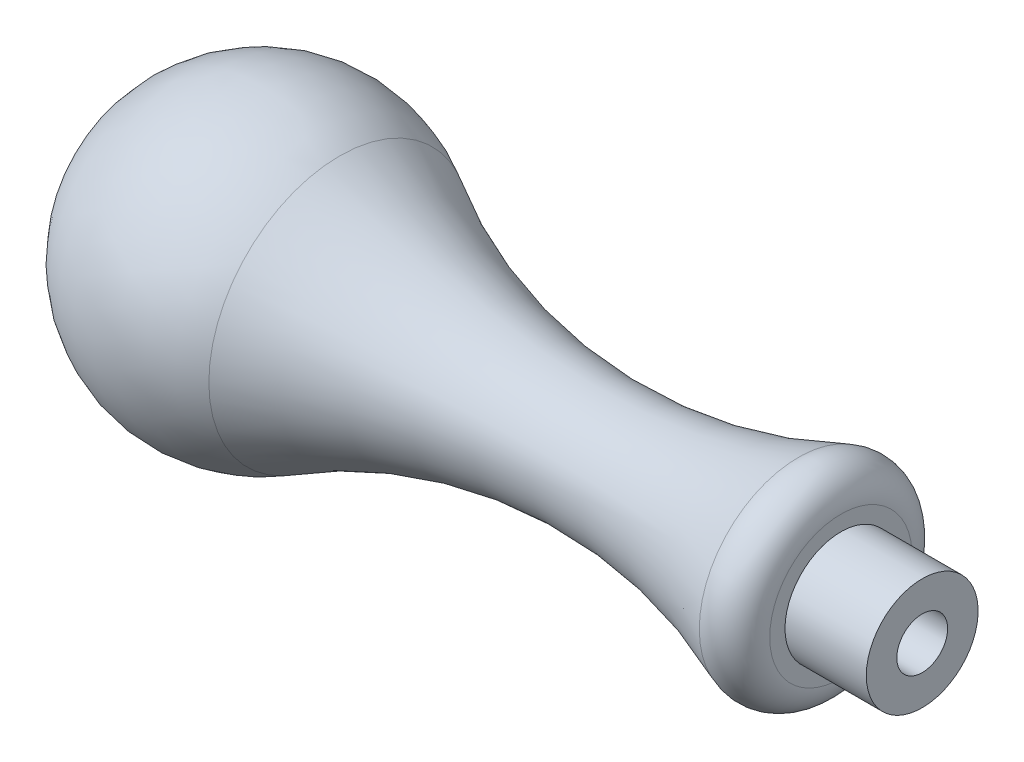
ISO-10303-21;
HEADER;
FILE_DESCRIPTION(('STEP AP214'),'2;1');
FILE_NAME('part.step','',(''),(''),'','','');
FILE_SCHEMA(('AUTOMOTIVE_DESIGN { 1 0 10303 214 1 1 1 1 }'));
ENDSEC;
DATA;
#1=APPLICATION_CONTEXT('core data for automotive mechanical design processes');
#2=APPLICATION_PROTOCOL_DEFINITION('international standard','automotive_design',2000,#1);
#3=PRODUCT_CONTEXT('',#1,'mechanical');
#4=PRODUCT('Part','Part','',(#3));
#5=PRODUCT_RELATED_PRODUCT_CATEGORY('part','',(#4));
#6=PRODUCT_DEFINITION_FORMATION('','',#4);
#7=PRODUCT_DEFINITION_CONTEXT('part definition',#1,'design');
#8=PRODUCT_DEFINITION('design','',#6,#7);
#9=PRODUCT_DEFINITION_SHAPE('','',#8);
#10=(LENGTH_UNIT() NAMED_UNIT(*) SI_UNIT(.MILLI.,.METRE.));
#11=(NAMED_UNIT(*) PLANE_ANGLE_UNIT() SI_UNIT($,.RADIAN.));
#12=(NAMED_UNIT(*) SI_UNIT($,.STERADIAN.) SOLID_ANGLE_UNIT());
#13=UNCERTAINTY_MEASURE_WITH_UNIT(LENGTH_MEASURE(1.E-05),#10,'distance_accuracy_value','');
#14=(GEOMETRIC_REPRESENTATION_CONTEXT(3) GLOBAL_UNCERTAINTY_ASSIGNED_CONTEXT((#13)) GLOBAL_UNIT_ASSIGNED_CONTEXT((#10,
#11,#12)) REPRESENTATION_CONTEXT('',''));
#15=CARTESIAN_POINT('',(0.,0.,0.));
#16=DIRECTION('',(0.,0.,1.));
#17=DIRECTION('',(1.,0.,0.));
#18=AXIS2_PLACEMENT_3D('',#15,#16,#17);
#19=CARTESIAN_POINT('',(0.,0.,0.));
#20=DIRECTION('',(-1.,0.,0.));
#21=DIRECTION('',(0.,1.,0.));
#22=AXIS2_PLACEMENT_3D('',#19,#20,#21);
#23=SPHERICAL_SURFACE('',#22,15.);
#24=CARTESIAN_POINT('',(7.69177216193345,0.,0.));
#25=DIRECTION('',(-1.,0.,0.));
#26=DIRECTION('',(0.,0.,1.));
#27=AXIS2_PLACEMENT_3D('',#24,#25,#26);
#28=CIRCLE('',#27,12.8777576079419);
#29=CARTESIAN_POINT('',(7.69177216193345,0.,12.8777576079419));
#30=VERTEX_POINT('',#29);
#31=EDGE_CURVE('E10',#30,#30,#28,.T.);
#32=ORIENTED_EDGE('',*,*,#31,.T.);
#33=EDGE_LOOP('',(#32));
#34=FACE_BOUND('',#33,.T.);
#35=ADVANCED_FACE('F31',(#34),#23,.T.);
#36=CARTESIAN_POINT('',(33.3310127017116,0.,0.));
#37=DIRECTION('',(-1.,0.,0.));
#38=DIRECTION('',(0.,0.,1.));
#39=AXIS2_PLACEMENT_3D('',#36,#37,#38);
#40=TOROIDAL_SURFACE('',#39,55.8036163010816,50.);
#41=ORIENTED_EDGE('',*,*,#31,.F.);
#42=EDGE_LOOP('',(#41));
#43=FACE_BOUND('',#42,.T.);
#44=CARTESIAN_POINT('',(52.8300573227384,0.,0.));
#45=DIRECTION('',(-1.,0.,0.));
#46=DIRECTION('',(0.,0.,1.));
#47=AXIS2_PLACEMENT_3D('',#44,#45,#46);
#48=CIRCLE('',#47,9.76246884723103);
#49=CARTESIAN_POINT('',(52.8300573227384,0.,9.76246884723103));
#50=VERTEX_POINT('',#49);
#51=EDGE_CURVE('E37',#50,#50,#48,.T.);
#52=ORIENTED_EDGE('',*,*,#51,.T.);
#53=EDGE_LOOP('',(#52));
#54=FACE_BOUND('',#53,.T.);
#55=ADVANCED_FACE('F72',(#43,#54),#40,.F.);
#56=CARTESIAN_POINT('',(54.,0.,0.));
#57=DIRECTION('',(-1.,0.,0.));
#58=DIRECTION('',(0.,0.,1.));
#59=AXIS2_PLACEMENT_3D('',#56,#57,#58);
#60=TOROIDAL_SURFACE('',#59,7.,3.);
#61=ORIENTED_EDGE('',*,*,#51,.F.);
#62=EDGE_LOOP('',(#61));
#63=FACE_BOUND('',#62,.T.);
#64=CARTESIAN_POINT('',(57.,0.,0.));
#65=DIRECTION('',(-1.,0.,0.));
#66=DIRECTION('',(0.,0.,1.));
#67=AXIS2_PLACEMENT_3D('',#64,#65,#66);
#68=CIRCLE('',#67,7.);
#69=CARTESIAN_POINT('',(57.,0.,7.));
#70=VERTEX_POINT('',#69);
#71=EDGE_CURVE('E41',#70,#70,#68,.T.);
#72=ORIENTED_EDGE('',*,*,#71,.T.);
#73=EDGE_LOOP('',(#72));
#74=FACE_BOUND('',#73,.T.);
#75=ADVANCED_FACE('F76',(#63,#74),#60,.T.);
#76=CARTESIAN_POINT('',(57.,7.,0.));
#77=DIRECTION('',(-1.,0.,0.));
#78=DIRECTION('',(0.,0.,1.));
#79=AXIS2_PLACEMENT_3D('',#76,#77,#78);
#80=PLANE('',#79);
#81=ORIENTED_EDGE('',*,*,#71,.F.);
#82=EDGE_LOOP('',(#81));
#83=FACE_BOUND('',#82,.T.);
#84=CARTESIAN_POINT('',(57.,0.,0.));
#85=DIRECTION('',(-1.,0.,0.));
#86=DIRECTION('',(0.,0.,1.));
#87=AXIS2_PLACEMENT_3D('',#84,#85,#86);
#88=CIRCLE('',#87,5.5);
#89=CARTESIAN_POINT('',(57.,0.,5.5));
#90=VERTEX_POINT('',#89);
#91=EDGE_CURVE('E45',#90,#90,#88,.T.);
#92=ORIENTED_EDGE('',*,*,#91,.T.);
#93=EDGE_LOOP('',(#92));
#94=FACE_BOUND('',#93,.T.);
#95=ADVANCED_FACE('F81',(#83,#94),#80,.F.);
#96=CARTESIAN_POINT('',(-15.,0.,0.));
#97=DIRECTION('',(-1.,0.,0.));
#98=DIRECTION('',(0.,0.,1.));
#99=AXIS2_PLACEMENT_3D('',#96,#97,#98);
#100=CYLINDRICAL_SURFACE('',#99,5.5);
#101=ORIENTED_EDGE('',*,*,#91,.F.);
#102=EDGE_LOOP('',(#101));
#103=FACE_BOUND('',#102,.T.);
#104=CARTESIAN_POINT('',(65.,0.,0.));
#105=DIRECTION('',(-1.,0.,0.));
#106=DIRECTION('',(0.,0.,1.));
#107=AXIS2_PLACEMENT_3D('',#104,#105,#106);
#108=CIRCLE('',#107,5.5);
#109=CARTESIAN_POINT('',(65.,0.,5.5));
#110=VERTEX_POINT('',#109);
#111=EDGE_CURVE('E50',#110,#110,#108,.T.);
#112=ORIENTED_EDGE('',*,*,#111,.T.);
#113=EDGE_LOOP('',(#112));
#114=FACE_BOUND('',#113,.T.);
#115=ADVANCED_FACE('F87',(#103,#114),#100,.T.);
#116=CARTESIAN_POINT('',(65.,5.5,0.));
#117=DIRECTION('',(-1.,0.,0.));
#118=DIRECTION('',(0.,0.,1.));
#119=AXIS2_PLACEMENT_3D('',#116,#117,#118);
#120=PLANE('',#119);
#121=ORIENTED_EDGE('',*,*,#111,.F.);
#122=EDGE_LOOP('',(#121));
#123=FACE_BOUND('',#122,.T.);
#124=CARTESIAN_POINT('',(65.,0.,0.));
#125=DIRECTION('',(-1.,0.,0.));
#126=DIRECTION('',(0.,0.,1.));
#127=AXIS2_PLACEMENT_3D('',#124,#125,#126);
#128=CIRCLE('',#127,2.5);
#129=CARTESIAN_POINT('',(65.,0.,2.5));
#130=VERTEX_POINT('',#129);
#131=EDGE_CURVE('E53',#130,#130,#128,.T.);
#132=ORIENTED_EDGE('',*,*,#131,.T.);
#133=EDGE_LOOP('',(#132));
#134=FACE_BOUND('',#133,.T.);
#135=ADVANCED_FACE('F68',(#123,#134),#120,.F.);
#136=CARTESIAN_POINT('',(-15.,0.,0.));
#137=DIRECTION('',(-1.,0.,0.));
#138=DIRECTION('',(0.,0.,1.));
#139=AXIS2_PLACEMENT_3D('',#136,#137,#138);
#140=CYLINDRICAL_SURFACE('',#139,2.5);
#141=ORIENTED_EDGE('',*,*,#131,.F.);
#142=EDGE_LOOP('',(#141));
#143=FACE_BOUND('',#142,.T.);
#144=CARTESIAN_POINT('',(60.,0.,0.));
#145=DIRECTION('',(-1.,0.,0.));
#146=DIRECTION('',(0.,0.,1.));
#147=AXIS2_PLACEMENT_3D('',#144,#145,#146);
#148=CIRCLE('',#147,2.5);
#149=CARTESIAN_POINT('',(60.,0.,2.5));
#150=VERTEX_POINT('',#149);
#151=EDGE_CURVE('E56',#150,#150,#148,.T.);
#152=ORIENTED_EDGE('',*,*,#151,.T.);
#153=EDGE_LOOP('',(#152));
#154=FACE_BOUND('',#153,.T.);
#155=ADVANCED_FACE('F60',(#143,#154),#140,.F.);
#156=CARTESIAN_POINT('',(60.,2.5,0.));
#157=DIRECTION('',(-1.,0.,0.));
#158=DIRECTION('',(0.,0.,1.));
#159=AXIS2_PLACEMENT_3D('',#156,#157,#158);
#160=PLANE('',#159);
#161=ORIENTED_EDGE('',*,*,#151,.F.);
#162=EDGE_LOOP('',(#161));
#163=FACE_BOUND('',#162,.T.);
#164=ADVANCED_FACE('F62',(#163),#160,.F.);
#165=CLOSED_SHELL('',(#35,#55,#75,#95,#115,#135,#155,#164));
#166=MANIFOLD_SOLID_BREP('B2',#165);
#167=ADVANCED_BREP_SHAPE_REPRESENTATION('',(#18,#166),#14);
#168=SHAPE_DEFINITION_REPRESENTATION(#9,#167);
ENDSEC;
END-ISO-10303-21;
